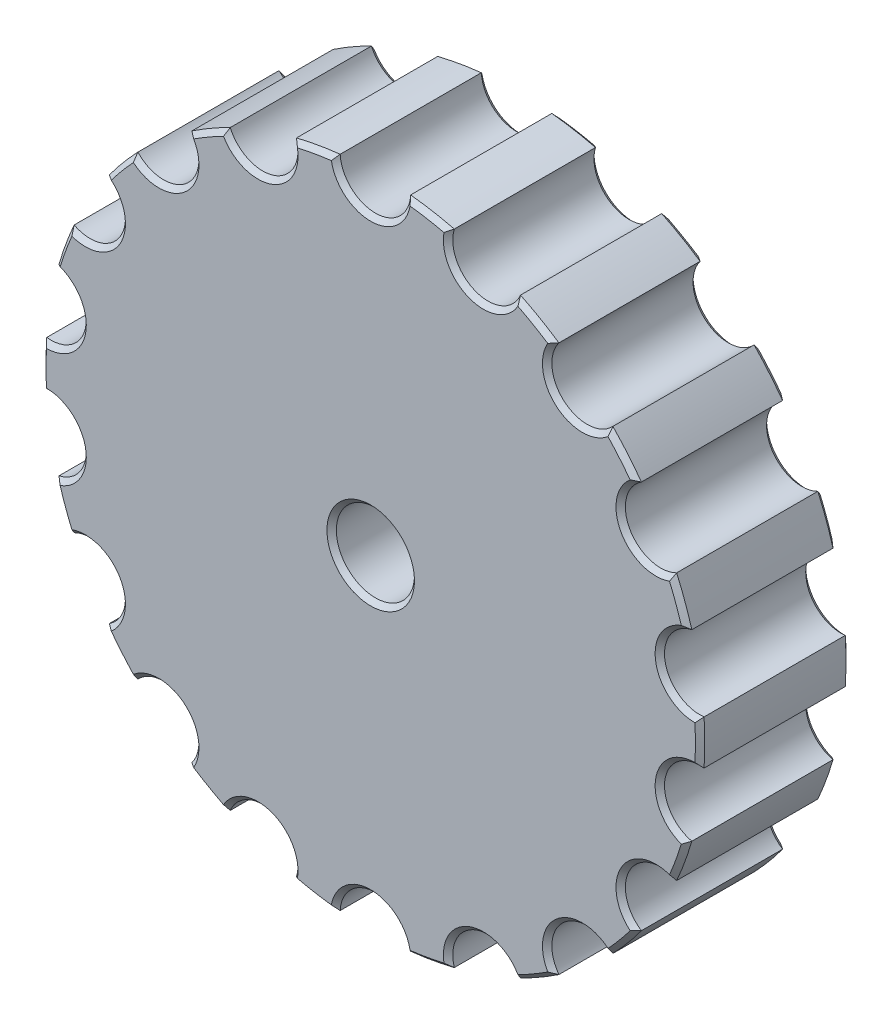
from build123d import *

# Parameters (mm, degrees)
ESQUISSE1_R             = 8.3
BOSS_EXTRU_1_DEPTH      = 16
ENL_V_MAT_EXTRU_2_DEPTH = 13
CHANFREIN1_SIZE         = 1


with BuildPart() as part:
    # Esquisse1 → Boss.-Extru.1 (new, symmetric)
    with BuildSketch(Plane.XY):
        with BuildLine():
            ThreePointArc((16.766416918, 67.962395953), (14.469095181, 68.488285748), (12.155372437, 68.936542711))
            ThreePointArc((12.155372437, 68.936542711), (9.827871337, 69.306658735), (7.48923015, 69.598214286))
            ThreePointArc((7.48923015, 69.598214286), (0, 62.5), (-7.48923015, 69.598214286))
            ThreePointArc((-7.48923015, 69.598214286), (-9.827871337, 69.306658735), (-12.155372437, 68.936542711))
            ThreePointArc((-12.155372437, 68.936542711), (-14.469095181, 68.488285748), (-16.766416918, 67.962395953))
            ThreePointArc((-16.766416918, 67.962395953), (-21.376258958, 58.730788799), (-30.841565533, 62.839460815))
            ThreePointArc((-30.841565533, 62.839460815), (-32.939451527, 61.765625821), (-35, 60.621778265))
            ThreePointArc((-35, 60.621778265), (-37.020875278, 59.40921472), (-38.99978666, 58.129309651))
            ThreePointArc((-38.99978666, 58.129309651), (-40.174225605, 47.877777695), (-50.473952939, 48.501340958))
            ThreePointArc((-50.473952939, 48.501340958), (-52.078047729, 46.77474687), (-53.623111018, 44.995132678))
            ThreePointArc((-53.623111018, 44.995132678), (-55.107391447, 43.16451561), (-56.529206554, 41.284970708))
            ThreePointArc((-56.529206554, 41.284970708), (-54.126587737, 31.25), (-64.018436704, 28.313243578))
            ThreePointArc((-64.018436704, 28.313243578), (-64.935262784, 26.142143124), (-65.778483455, 23.941410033))
            ThreePointArc((-65.778483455, 23.941410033), (-66.547142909, 21.713538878), (-67.240369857, 19.461054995))
            ThreePointArc((-67.240369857, 19.461054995), (-61.550484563, 10.853011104), (-69.841352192, 4.710151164))
            ThreePointArc((-69.841352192, 4.710151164), (-69.960326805, 2.356411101), (-70, 0))
            ThreePointArc((-70, 0), (-69.960326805, -2.356411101), (-69.841352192, -4.710151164))
            ThreePointArc((-69.841352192, -4.710151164), (-61.550484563, -10.853011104), (-67.240369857, -19.461054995))
            ThreePointArc((-67.240369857, -19.461054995), (-66.547142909, -21.713538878), (-65.778483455, -23.941410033))
            ThreePointArc((-65.778483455, -23.941410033), (-64.935262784, -26.142143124), (-64.018436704, -28.313243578))
            ThreePointArc((-64.018436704, -28.313243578), (-54.126587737, -31.25), (-56.529206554, -41.284970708))
            ThreePointArc((-56.529206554, -41.284970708), (-55.107391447, -43.16451561), (-53.623111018, -44.995132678))
            ThreePointArc((-53.623111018, -44.995132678), (-52.078047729, -46.77474687), (-50.473952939, -48.501340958))
            ThreePointArc((-50.473952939, -48.501340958), (-40.174225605, -47.877777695), (-38.99978666, -58.129309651))
            ThreePointArc((-38.99978666, -58.129309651), (-37.020875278, -59.40921472), (-35, -60.621778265))
            ThreePointArc((-35, -60.621778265), (-32.939451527, -61.765625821), (-30.841565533, -62.839460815))
            ThreePointArc((-30.841565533, -62.839460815), (-21.376258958, -58.730788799), (-16.766416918, -67.962395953))
            ThreePointArc((-16.766416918, -67.962395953), (-14.469095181, -68.488285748), (-12.155372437, -68.936542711))
            ThreePointArc((-12.155372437, -68.936542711), (-9.827871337, -69.306658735), (-7.48923015, -69.598214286))
            ThreePointArc((-7.48923015, -69.598214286), (0, -62.5), (7.48923015, -69.598214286))
            ThreePointArc((7.48923015, -69.598214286), (9.827871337, -69.306658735), (12.155372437, -68.936542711))
            ThreePointArc((12.155372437, -68.936542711), (14.469095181, -68.488285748), (16.766416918, -67.962395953))
            ThreePointArc((16.766416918, -67.962395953), (21.376258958, -58.730788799), (30.841565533, -62.839460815))
            ThreePointArc((30.841565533, -62.839460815), (32.939451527, -61.765625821), (35, -60.621778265))
            ThreePointArc((35, -60.621778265), (37.020875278, -59.40921472), (38.99978666, -58.129309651))
            ThreePointArc((38.99978666, -58.129309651), (40.174225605, -47.877777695), (50.473952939, -48.501340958))
            ThreePointArc((50.473952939, -48.501340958), (52.078047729, -46.77474687), (53.623111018, -44.995132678))
            ThreePointArc((53.623111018, -44.995132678), (55.107391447, -43.16451561), (56.529206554, -41.284970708))
            ThreePointArc((56.529206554, -41.284970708), (54.126587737, -31.25), (64.018436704, -28.313243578))
            ThreePointArc((64.018436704, -28.313243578), (64.935262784, -26.142143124), (65.778483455, -23.941410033))
            ThreePointArc((65.778483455, -23.941410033), (66.547142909, -21.713538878), (67.240369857, -19.461054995))
            ThreePointArc((67.240369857, -19.461054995), (61.550484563, -10.853011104), (69.841352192, -4.710151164))
            ThreePointArc((69.841352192, -4.710151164), (69.960326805, -2.356411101), (70, 0))
            ThreePointArc((70, 0), (69.960326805, 2.356411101), (69.841352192, 4.710151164))
            ThreePointArc((69.841352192, 4.710151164), (61.550484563, 10.853011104), (67.240369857, 19.461054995))
            ThreePointArc((67.240369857, 19.461054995), (66.547142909, 21.713538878), (65.778483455, 23.941410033))
            ThreePointArc((65.778483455, 23.941410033), (64.935262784, 26.142143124), (64.018436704, 28.313243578))
            ThreePointArc((64.018436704, 28.313243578), (54.126587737, 31.25), (56.529206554, 41.284970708))
            ThreePointArc((56.529206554, 41.284970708), (55.107391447, 43.16451561), (53.623111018, 44.995132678))
            ThreePointArc((53.623111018, 44.995132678), (52.078047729, 46.77474687), (50.473952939, 48.501340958))
            ThreePointArc((50.473952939, 48.501340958), (40.174225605, 47.877777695), (38.99978666, 58.129309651))
            ThreePointArc((38.99978666, 58.129309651), (37.020875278, 59.40921472), (35, 60.621778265))
            ThreePointArc((35, 60.621778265), (32.939451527, 61.765625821), (30.841565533, 62.839460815))
            ThreePointArc((30.841565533, 62.839460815), (21.376258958, 58.730788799), (16.766416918, 67.962395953))
        make_face()
        Circle(ESQUISSE1_R, mode=Mode.SUBTRACT)
    extrude(amount=BOSS_EXTRU_1_DEPTH, both=True)

    # Esquisse4 → Enl_v. mat.-Extru.2 (cut)
    with BuildSketch(Plane(origin=(0, 0, -16), x_dir=(-1, 0, 0), z_dir=(0, 0, -1))):
        Polygon((-14.202816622, 0), (-7.101408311, -12.3), (7.101408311, -12.3), (14.202816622, 0), (7.101408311, 12.3), (-7.101408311, 12.3), align=None)
    extrude(amount=-ENL_V_MAT_EXTRU_2_DEPTH, mode=Mode.SUBTRACT)

    # Chanfrein1
    chanfrein1_edges = [part.edges().sort_by_distance(p)[0] for p in [
        (-21.376258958, 58.730788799, 16),
        (40.174225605, -47.877777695, 16),
        (52.078047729, -46.77474687, 16),
        (54.126587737, -31.25, 16),
        (64.935262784, -26.142143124, 16),
        (61.550484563, -10.853011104, 16),
        (69.960326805, -2.356411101, 16),
        (10.652112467, 6.15, -16),
        (10.652112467, -6.15, -16),
        (0, -12.3, -16),
        (-10.652112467, -6.15, -16),
        (-10.652112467, 6.15, -16),
        (0, 12.3, -16),
        (61.550484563, 10.853011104, 16),
        (66.547142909, 21.713538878, 16),
        (54.126587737, 31.25, 16),
        (-32.939451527, 61.765625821, 16),
        (55.107391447, 43.16451561, 16),
        (40.174225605, 47.877777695, 16),
        (37.020875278, 59.40921472, 16),
        (21.376258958, 58.730788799, 16),
        (9.827871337, 69.306658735, 16),
        (0, 62.5, 16),
        (-9.827871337, 69.306658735, 16),
        (-40.174225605, 47.877777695, 16),
        (-52.078047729, 46.77474687, 16),
        (-54.126587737, 31.25, 16),
        (-64.935262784, 26.142143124, 16),
        (-61.550484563, 10.853011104, 16),
        (-9.827871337, 69.306658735, -16),
        (0, 62.5, -16),
        (9.827871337, 69.306658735, -16),
        (21.376258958, 58.730788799, -16),
        (37.020875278, 59.40921472, -16),
        (40.174225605, 47.877777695, -16),
        (55.107391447, 43.16451561, -16),
        (54.126587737, 31.25, -16),
        (-69.960326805, 2.356411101, 16),
        (66.547142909, 21.713538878, -16),
        (61.550484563, 10.853011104, -16),
        (69.960326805, -2.356411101, -16),
        (61.550484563, -10.853011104, -16),
        (64.935262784, -26.142143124, -16),
        (54.126587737, -31.25, -16),
        (52.078047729, -46.77474687, -16),
        (40.174225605, -47.877777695, -16),
        (32.939451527, -61.765625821, -16),
        (-61.550484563, -10.853011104, 16),
        (21.376258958, -58.730788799, -16),
        (9.827871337, -69.306658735, -16),
        (0, -62.5, -16),
        (-14.469095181, -68.488285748, -16),
        (-21.376258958, -58.730788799, -16),
        (-37.020875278, -59.40921472, -16),
        (-40.174225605, -47.877777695, -16),
        (-66.547142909, -21.713538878, 16),
        (-55.107391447, -43.16451561, -16),
        (-54.126587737, -31.25, -16),
        (-66.547142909, -21.713538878, -16),
        (-61.550484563, -10.853011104, -16),
        (-69.960326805, 2.356411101, -16),
        (-61.550484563, 10.853011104, -16),
        (-64.935262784, 26.142143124, -16),
        (-54.126587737, 31.25, -16),
        (-52.078047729, 46.77474687, -16),
        (-54.126587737, -31.25, 16),
        (-40.174225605, 47.877777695, -16),
        (-32.939451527, 61.765625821, -16),
        (-21.376258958, 58.730788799, -16),
        (-55.107391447, -43.16451561, 16),
        (-8.3, 0, 16),
        (-40.174225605, -47.877777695, 16),
        (-37.020875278, -59.40921472, 16),
        (-21.376258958, -58.730788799, 16),
        (-14.469095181, -68.488285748, 16),
        (0, -62.5, 16),
        (9.827871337, -69.306658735, 16),
        (21.376258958, -58.730788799, 16),
        (32.939451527, -61.765625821, 16),
    ]]
    chamfer(chanfrein1_edges, length=CHANFREIN1_SIZE)


solid = part.part
